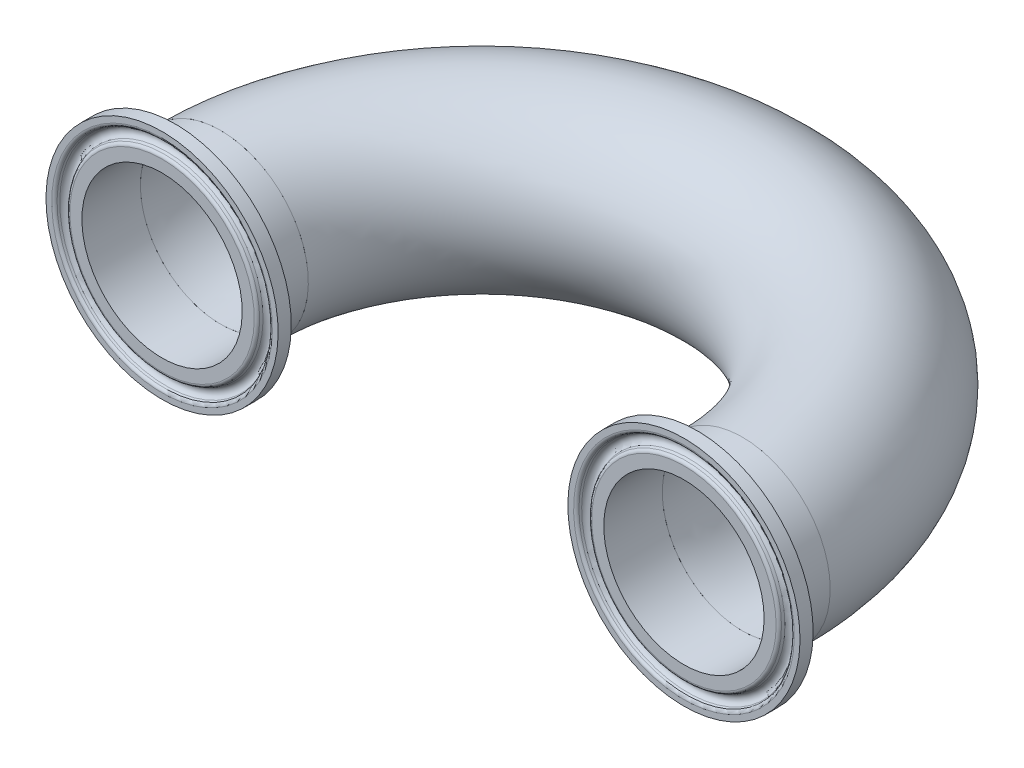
ISO-10303-21;
HEADER;
FILE_DESCRIPTION(('STEP AP214'),'2;1');
FILE_NAME('part.step','',(''),(''),'','','');
FILE_SCHEMA(('AUTOMOTIVE_DESIGN { 1 0 10303 214 1 1 1 1 }'));
ENDSEC;
DATA;
#1=APPLICATION_CONTEXT('core data for automotive mechanical design processes');
#2=APPLICATION_PROTOCOL_DEFINITION('international standard','automotive_design',2000,#1);
#3=PRODUCT_CONTEXT('',#1,'mechanical');
#4=PRODUCT('Part','Part','',(#3));
#5=PRODUCT_RELATED_PRODUCT_CATEGORY('part','',(#4));
#6=PRODUCT_DEFINITION_FORMATION('','',#4);
#7=PRODUCT_DEFINITION_CONTEXT('part definition',#1,'design');
#8=PRODUCT_DEFINITION('design','',#6,#7);
#9=PRODUCT_DEFINITION_SHAPE('','',#8);
#10=(LENGTH_UNIT() NAMED_UNIT(*) SI_UNIT(.MILLI.,.METRE.));
#11=(NAMED_UNIT(*) PLANE_ANGLE_UNIT() SI_UNIT($,.RADIAN.));
#12=(NAMED_UNIT(*) SI_UNIT($,.STERADIAN.) SOLID_ANGLE_UNIT());
#13=UNCERTAINTY_MEASURE_WITH_UNIT(LENGTH_MEASURE(1.E-05),#10,'distance_accuracy_value','');
#14=(GEOMETRIC_REPRESENTATION_CONTEXT(3) GLOBAL_UNCERTAINTY_ASSIGNED_CONTEXT((#13)) GLOBAL_UNIT_ASSIGNED_CONTEXT((#10,
#11,#12)) REPRESENTATION_CONTEXT('',''));
#15=CARTESIAN_POINT('',(0.,0.,0.));
#16=DIRECTION('',(0.,0.,1.));
#17=DIRECTION('',(1.,0.,0.));
#18=AXIS2_PLACEMENT_3D('',#15,#16,#17);
#19=CARTESIAN_POINT('',(-9.0308097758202,66.8355473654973,99.0497360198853));
#20=DIRECTION('',(0.,0.,-1.));
#21=DIRECTION('',(-1.,0.,0.));
#22=AXIS2_PLACEMENT_3D('',#19,#20,#21);
#23=CIRCLE('',#22,19.05);
#24=CARTESIAN_POINT('',(48.116900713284,66.8355473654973,99.5612884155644));
#25=DIRECTION('',(0.,-1.,0.));
#26=AXIS1_PLACEMENT('',#24,#25);
#27=SURFACE_OF_REVOLUTION('',#23,#26);
#28=CARTESIAN_POINT('',(-28.0808097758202,66.8355473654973,99.0497360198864));
#29=VERTEX_POINT('',#28);
#30=EDGE_CURVE('P0_E10',#29,#29,#23,.T.);
#31=ORIENTED_EDGE('',*,*,#30,.T.);
#32=EDGE_LOOP('',(#31));
#33=FACE_BOUND('',#32,.T.);
#34=CARTESIAN_POINT('',(105.264611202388,66.8355473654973,100.072840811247));
#35=DIRECTION('',(0.,0.,1.));
#36=DIRECTION('',(1.,0.,0.));
#37=AXIS2_PLACEMENT_3D('',#34,#35,#36);
#38=CIRCLE('',#37,19.05);
#39=CARTESIAN_POINT('',(124.314611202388,66.8355473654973,100.072840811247));
#40=VERTEX_POINT('',#39);
#41=EDGE_CURVE('P0_E22',#40,#40,#38,.T.);
#42=ORIENTED_EDGE('',*,*,#41,.F.);
#43=EDGE_LOOP('',(#42));
#44=FACE_BOUND('',#43,.T.);
#45=ADVANCED_FACE('P0_F15',(#33,#44),#27,.F.);
#46=CARTESIAN_POINT('',(-9.0308097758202,66.8355473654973,99.0497360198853));
#47=DIRECTION('',(0.,0.,-1.));
#48=DIRECTION('',(-1.,0.,0.));
#49=AXIS2_PLACEMENT_3D('',#46,#47,#48);
#50=PLANE('',#49);
#51=CARTESIAN_POINT('',(8.36804757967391,66.8355473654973,99.0497360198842));
#52=CARTESIAN_POINT('',(8.36804880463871,66.3466914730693,99.0497360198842));
#53=CARTESIAN_POINT('',(8.34742919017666,65.8578682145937,99.0497360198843));
#54=CARTESIAN_POINT('',(8.28571312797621,65.1272947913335,99.0497360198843));
#55=CARTESIAN_POINT('',(8.26000280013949,64.8841715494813,99.0497360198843));
#56=CARTESIAN_POINT('',(8.19835654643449,64.3991598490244,99.0497360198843));
#57=CARTESIAN_POINT('',(8.16241786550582,64.1572717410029,99.0497360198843));
#58=CARTESIAN_POINT('',(8.03927717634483,63.4337753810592,99.0497360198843));
#59=CARTESIAN_POINT('',(7.93678025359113,62.9546867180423,99.0497360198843));
#60=CARTESIAN_POINT('',(7.69175482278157,62.0068605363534,99.0497360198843));
#61=CARTESIAN_POINT('',(7.54922645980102,61.5381229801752,99.0497360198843));
#62=CARTESIAN_POINT('',(7.30625823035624,60.8454580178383,99.0497360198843));
#63=CARTESIAN_POINT('',(7.22041291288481,60.6163248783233,99.0497360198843));
#64=CARTESIAN_POINT('',(7.03916353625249,60.1619403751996,99.0497360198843));
#65=CARTESIAN_POINT('',(6.94376192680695,59.9366880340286,99.0497360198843));
#66=CARTESIAN_POINT('',(6.64340929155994,59.2672218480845,99.0497360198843));
#67=CARTESIAN_POINT('',(6.42429767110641,58.8292623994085,99.0497360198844));
#68=CARTESIAN_POINT('',(5.95004175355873,57.9735290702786,99.0497360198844));
#69=CARTESIAN_POINT('',(5.6949066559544,57.5557500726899,99.0497360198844));
#70=CARTESIAN_POINT('',(5.15034599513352,56.7431536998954,99.0497360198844));
#71=CARTESIAN_POINT('',(4.86092056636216,56.3483362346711,99.0497360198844));
#72=CARTESIAN_POINT('',(4.24981402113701,55.5844508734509,99.0497360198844));
#73=CARTESIAN_POINT('',(3.92812978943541,55.2153854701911,99.0497360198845));
#74=CARTESIAN_POINT('',(3.25481332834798,54.5056642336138,99.0497360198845));
#75=CARTESIAN_POINT('',(2.90318106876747,54.1650084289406,99.0497360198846));
#76=CARTESIAN_POINT('',(2.17245497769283,53.5145174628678,99.0497360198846));
#77=CARTESIAN_POINT('',(1.79336007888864,53.2046835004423,99.0497360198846));
#78=CARTESIAN_POINT('',(1.01041600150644,52.6180538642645,99.0497360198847));
#79=CARTESIAN_POINT('',(0.606566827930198,52.3412581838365,99.0497360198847));
#80=CARTESIAN_POINT('',(-0.223002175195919,51.8226808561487,99.0497360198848));
#81=CARTESIAN_POINT('',(-0.648721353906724,51.5808981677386,99.0497360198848));
#82=CARTESIAN_POINT('',(-1.51901480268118,51.1340559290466,99.0497360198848));
#83=CARTESIAN_POINT('',(-1.96358907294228,50.9289963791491,99.0497360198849));
#84=CARTESIAN_POINT('',(-2.86843108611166,50.5570586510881,99.0497360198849));
#85=CARTESIAN_POINT('',(-3.32869879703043,50.3901803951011,99.0497360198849));
#86=CARTESIAN_POINT('',(-4.26165631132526,50.0957910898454,99.049736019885));
#87=CARTESIAN_POINT('',(-4.73434611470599,49.9682800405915,99.049736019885));
#88=CARTESIAN_POINT('',(-5.68878741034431,49.7535316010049,99.0497360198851));
#89=CARTESIAN_POINT('',(-6.17053890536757,49.666294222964,99.0497360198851));
#90=CARTESIAN_POINT('',(-7.13967847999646,49.5327133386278,99.0497360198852));
#91=CARTESIAN_POINT('',(-7.6270665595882,49.4863698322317,99.0497360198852));
#92=CARTESIAN_POINT('',(-8.60401340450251,49.4349061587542,99.0497360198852));
#93=CARTESIAN_POINT('',(-9.0935721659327,49.4297859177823,99.0497360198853));
#94=CARTESIAN_POINT('',(-10.0713808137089,49.460804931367,99.0497360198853));
#95=CARTESIAN_POINT('',(-10.5596307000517,49.4969441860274,99.0497360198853));
#96=CARTESIAN_POINT('',(-11.531352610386,49.6102254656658,99.0497360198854));
#97=CARTESIAN_POINT('',(-12.0148246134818,49.6873676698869,99.0497360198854));
#98=CARTESIAN_POINT('',(-12.9735514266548,49.882106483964,99.0497360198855));
#99=CARTESIAN_POINT('',(-13.4488062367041,49.9997030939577,99.0497360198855));
#100=CARTESIAN_POINT('',(-14.3877204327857,50.2745147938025,99.0497360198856));
#101=CARTESIAN_POINT('',(-14.8513798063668,50.4317299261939,99.0497360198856));
#102=CARTESIAN_POINT('',(-15.7638063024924,50.7846608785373,99.0497360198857));
#103=CARTESIAN_POINT('',(-16.2125734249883,50.9803766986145,99.0497360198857));
#104=CARTESIAN_POINT('',(-17.0920268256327,51.4089184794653,99.0497360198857));
#105=CARTESIAN_POINT('',(-17.5227130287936,51.6417445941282,99.0497360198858));
#106=CARTESIAN_POINT('',(-18.3629407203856,52.1428511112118,99.0497360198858));
#107=CARTESIAN_POINT('',(-18.772482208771,52.4111315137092,99.0497360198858));
#108=CARTESIAN_POINT('',(-19.5675087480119,52.9812391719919,99.0497360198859));
#109=CARTESIAN_POINT('',(-19.952993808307,53.2830664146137,99.0497360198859));
#110=CARTESIAN_POINT('',(-20.6971671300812,53.9181220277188,99.049736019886));
#111=CARTESIAN_POINT('',(-21.0558553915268,54.2513503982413,99.049736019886));
#112=CARTESIAN_POINT('',(-21.7438861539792,54.9468402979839,99.049736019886));
#113=CARTESIAN_POINT('',(-22.0732285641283,55.3091019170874,99.0497360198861));
#114=CARTESIAN_POINT('',(-22.7002249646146,56.0600819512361,99.0497360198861));
#115=CARTESIAN_POINT('',(-22.9978789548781,56.4488003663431,99.0497360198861));
#116=CARTESIAN_POINT('',(-23.5593824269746,57.2499304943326,99.0497360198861));
#117=CARTESIAN_POINT('',(-23.8232319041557,57.6623422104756,99.0497360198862));
#118=CARTESIAN_POINT('',(-24.3152505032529,58.507926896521,99.0497360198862));
#119=CARTESIAN_POINT('',(-24.5434196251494,58.9410998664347,99.0497360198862));
#120=CARTESIAN_POINT('',(-24.962455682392,59.8251281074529,99.0497360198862));
#121=CARTESIAN_POINT('',(-25.1533225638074,60.2759834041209,99.0497360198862));
#122=CARTESIAN_POINT('',(-25.4963967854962,61.1921704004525,99.0497360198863));
#123=CARTESIAN_POINT('',(-25.6486041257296,61.6575021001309,99.0497360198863));
#124=CARTESIAN_POINT('',(-25.9132771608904,62.599333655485,99.0497360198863));
#125=CARTESIAN_POINT('',(-26.0257428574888,63.075833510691,99.0497360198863));
#126=CARTESIAN_POINT('',(-26.2101330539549,64.0366137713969,99.0497360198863));
#127=CARTESIAN_POINT('',(-26.2820575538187,64.5208941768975,99.0497360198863));
#128=CARTESIAN_POINT('',(-26.3848540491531,65.4937928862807,99.0497360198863));
#129=CARTESIAN_POINT('',(-26.4157260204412,65.9824111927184,99.0497360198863));
#130=CARTESIAN_POINT('',(-26.4361978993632,66.9605116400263,99.0497360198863));
#131=CARTESIAN_POINT('',(-26.4257978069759,67.4499937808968,99.0497360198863));
#132=CARTESIAN_POINT('',(-26.3637994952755,68.426341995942,99.0497360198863));
#133=CARTESIAN_POINT('',(-26.3122012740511,68.9132080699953,99.0497360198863));
#134=CARTESIAN_POINT('',(-26.1681735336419,69.8808628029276,99.0497360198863));
#135=CARTESIAN_POINT('',(-26.0757440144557,70.3616514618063,99.0497360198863));
#136=CARTESIAN_POINT('',(-25.8507107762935,71.3137333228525,99.0497360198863));
#137=CARTESIAN_POINT('',(-25.718107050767,71.7850265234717,99.0497360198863));
#138=CARTESIAN_POINT('',(-25.4136681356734,72.7147667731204,99.0497360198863));
#139=CARTESIAN_POINT('',(-25.2418329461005,73.173213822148,99.0497360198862));
#140=CARTESIAN_POINT('',(-24.8601527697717,74.0740024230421,99.0497360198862));
#141=CARTESIAN_POINT('',(-24.650307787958,74.5163439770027,99.0497360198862));
#142=CARTESIAN_POINT('',(-24.1940998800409,75.3817768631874,99.0497360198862));
#143=CARTESIAN_POINT('',(-23.9477369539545,75.8048681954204,99.0497360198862));
#144=CARTESIAN_POINT('',(-23.4202447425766,76.6287925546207,99.0497360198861));
#145=CARTESIAN_POINT('',(-23.1391154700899,77.0296255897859,99.0497360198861));
#146=CARTESIAN_POINT('',(-22.5440891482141,77.8061838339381,99.0497360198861));
#147=CARTESIAN_POINT('',(-22.2301920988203,78.1819090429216,99.0497360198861));
#148=CARTESIAN_POINT('',(-21.5718617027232,78.9055805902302,99.049736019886));
#149=CARTESIAN_POINT('',(-21.2274283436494,79.2535269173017,99.049736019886));
#150=CARTESIAN_POINT('',(-20.5104741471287,79.9191668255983,99.049736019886));
#151=CARTESIAN_POINT('',(-20.1379533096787,80.23686040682,99.0497360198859));
#152=CARTESIAN_POINT('',(-19.3674727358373,80.8397360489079,99.0497360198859));
#153=CARTESIAN_POINT('',(-18.969513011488,81.124918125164,99.0497360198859));
#154=CARTESIAN_POINT('',(-18.1509837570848,81.6607434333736,99.0497360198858));
#155=CARTESIAN_POINT('',(-17.7304142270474,81.9113866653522,99.0497360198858));
#156=CARTESIAN_POINT('',(-16.869655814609,82.3763520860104,99.0497360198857));
#157=CARTESIAN_POINT('',(-16.4294669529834,82.5906743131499,99.0497360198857));
#158=CARTESIAN_POINT('',(-15.5325989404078,82.9814743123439,99.0497360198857));
#159=CARTESIAN_POINT('',(-15.075919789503,83.157952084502,99.0497360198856));
#160=CARTESIAN_POINT('',(-14.1493189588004,83.4718081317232,99.0497360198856));
#161=CARTESIAN_POINT('',(-13.6793973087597,83.6091864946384,99.0497360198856));
#162=CARTESIAN_POINT('',(-12.7296513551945,83.843867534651,99.0497360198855));
#163=CARTESIAN_POINT('',(-12.249827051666,83.9411702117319,99.0497360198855));
#164=CARTESIAN_POINT('',(-11.2836861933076,84.0950082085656,99.0497360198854));
#165=CARTESIAN_POINT('',(-10.7973696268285,84.1515434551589,99.0497360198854));
#166=CARTESIAN_POINT('',(-9.82170253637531,84.2234443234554,99.0497360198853));
#167=CARTESIAN_POINT('',(-9.33235201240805,84.2388099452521,99.0497360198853));
#168=CARTESIAN_POINT('',(-8.35409867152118,84.2282623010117,99.0497360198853));
#169=CARTESIAN_POINT('',(-7.8651958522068,84.2023492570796,99.0497360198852));
#170=CARTESIAN_POINT('',(-6.89131110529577,84.1094288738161,99.0497360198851));
#171=CARTESIAN_POINT('',(-6.40632917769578,84.0424215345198,99.0497360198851));
#172=CARTESIAN_POINT('',(-5.44373320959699,83.8677887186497,99.0497360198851));
#173=CARTESIAN_POINT('',(-4.9661191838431,83.7601631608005,99.049736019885));
#174=CARTESIAN_POINT('',(-4.02165563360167,83.5050590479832,99.049736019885));
#175=CARTESIAN_POINT('',(-3.55480610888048,83.3575804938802,99.049736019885));
#176=CARTESIAN_POINT('',(-2.63518423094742,83.0238165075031,99.0497360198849));
#177=CARTESIAN_POINT('',(-2.18241207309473,82.8375305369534,99.0497360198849));
#178=CARTESIAN_POINT('',(-1.2941707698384,82.4274774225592,99.0497360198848));
#179=CARTESIAN_POINT('',(-0.858701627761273,82.203710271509,99.0497360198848));
#180=CARTESIAN_POINT('',(-0.00817887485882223,81.7202948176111,99.0497360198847));
#181=CARTESIAN_POINT('',(0.406875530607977,81.4606479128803,99.0497360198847));
#182=CARTESIAN_POINT('',(1.2136350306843,80.907313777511,99.0497360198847));
#183=CARTESIAN_POINT('',(1.60534014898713,80.6136265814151,99.0497360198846));
#184=CARTESIAN_POINT('',(2.36257869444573,79.9943285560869,99.0497360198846));
#185=CARTESIAN_POINT('',(2.72811497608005,79.6687212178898,99.0497360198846));
#186=CARTESIAN_POINT('',(3.43045417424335,78.9878871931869,99.0497360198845));
#187=CARTESIAN_POINT('',(3.76725697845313,78.6326603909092,99.0497360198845));
#188=CARTESIAN_POINT('',(4.40986102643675,77.8949515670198,99.0497360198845));
#189=CARTESIAN_POINT('',(4.7156543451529,77.5124626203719,99.0497360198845));
#190=CARTESIAN_POINT('',(5.14927364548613,76.9205620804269,99.0497360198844));
#191=CARTESIAN_POINT('',(5.28963999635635,76.7202258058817,99.0497360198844));
#192=CARTESIAN_POINT('',(5.56184095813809,76.313762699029,99.0497360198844));
#193=CARTESIAN_POINT('',(5.69367337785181,76.1076343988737,99.0497360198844));
#194=CARTESIAN_POINT('',(6.07602675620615,75.4810540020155,99.0497360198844));
#195=CARTESIAN_POINT('',(6.31336367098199,75.0524612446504,99.0497360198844));
#196=CARTESIAN_POINT('',(6.7510543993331,74.1767876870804,99.0497360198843));
#197=CARTESIAN_POINT('',(6.95140807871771,73.7297068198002,99.0497360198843));
#198=CARTESIAN_POINT('',(7.22302691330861,73.0479338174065,99.0497360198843));
#199=CARTESIAN_POINT('',(7.30872227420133,72.8189019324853,99.0497360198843));
#200=CARTESIAN_POINT('',(7.47036629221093,72.3574918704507,99.0497360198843));
#201=CARTESIAN_POINT('',(7.54631757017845,72.1251146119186,99.0497360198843));
#202=CARTESIAN_POINT('',(7.75934887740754,71.4235842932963,99.0497360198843));
#203=CARTESIAN_POINT('',(7.88166993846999,70.9498730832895,99.0497360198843));
#204=CARTESIAN_POINT('',(8.11142250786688,69.8747896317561,99.0497360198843));
#205=CARTESIAN_POINT('',(8.20757148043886,69.2709875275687,99.0497360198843));
#206=CARTESIAN_POINT('',(8.33588325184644,68.0566224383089,99.0497360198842));
#207=CARTESIAN_POINT('',(8.36804604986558,67.4460594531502,99.0497360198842));
#208=CARTESIAN_POINT('',(8.36804757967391,66.8355473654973,99.0497360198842));
#209=B_SPLINE_CURVE_WITH_KNOTS('',3,(#51,#52,#53,#54,#55,#56,#57,#58,#59,#60,#61,#62,#63,#64,
#65,#66,#67,#68,#69,#70,#71,#72,#73,#74,#75,#76,#77,#78,#79,#80,#81,#82,#83,#84,#85,#86,#87,#88,
#89,#90,#91,#92,#93,#94,#95,#96,#97,#98,#99,#100,#101,#102,#103,#104,#105,#106,#107,#108,#109,
#110,#111,#112,#113,#114,#115,#116,#117,#118,#119,#120,#121,#122,#123,#124,#125,#126,#127,#128,
#129,#130,#131,#132,#133,#134,#135,#136,#137,#138,#139,#140,#141,#142,#143,#144,#145,#146,#147,
#148,#149,#150,#151,#152,#153,#154,#155,#156,#157,#158,#159,#160,#161,#162,#163,#164,#165,#166,
#167,#168,#169,#170,#171,#172,#173,#174,#175,#176,#177,#178,#179,#180,#181,#182,#183,#184,#185,
#186,#187,#188,#189,#190,#191,#192,#193,#194,#195,#196,#197,#198,#199,#200,#201,#202,#203,#204,
#205,#206,#207,#208),.UNSPECIFIED.,.T.,.F.,(4,2,2,2,2,2,2,2,2,2,2,2,2,2,2,2,2,2,2,2,2,2,2,2,2,2,
2,2,2,2,2,2,2,2,2,2,2,2,2,2,2,2,2,2,2,2,2,2,2,2,2,2,2,2,2,2,2,2,2,2,2,2,2,2,2,2,2,2,2,2,2,2,2,2,
2,2,2,2,4),(0.,1.46597263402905,2.19921582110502,2.93265669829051,4.40059365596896,
5.86852529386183,6.60239310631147,7.33607327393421,8.80331812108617,10.2701889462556,
11.7370540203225,13.2040608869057,14.6710692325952,16.1381346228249,17.6051997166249,
19.0722211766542,20.5392426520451,22.0062611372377,23.473279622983,24.9402985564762,
26.4073174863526,27.8743337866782,29.3413500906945,30.80837280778,32.2753955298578,
33.7424198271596,35.2094441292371,36.6764745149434,38.1435049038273,39.6105347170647,
41.0775645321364,42.5445988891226,44.0116332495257,45.4786678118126,46.9457023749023,
48.4127390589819,49.8797757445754,51.3468123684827,52.8138489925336,54.2808864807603,
55.7479239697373,57.2149615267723,58.6819990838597,60.1490368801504,61.616074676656,
63.0831122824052,64.5501498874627,66.0171869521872,67.4842240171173,68.9512616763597,
70.4182993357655,71.8853363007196,73.3523732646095,74.8194086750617,76.2864440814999,
77.7534761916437,79.2205083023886,80.6875430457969,82.1545777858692,83.6216046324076,
85.0886314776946,86.5556612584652,88.0226910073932,89.4897411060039,90.9567914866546,
92.4237847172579,93.8907764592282,95.3576079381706,96.8244451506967,98.2916563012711,
99.0253196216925,99.759170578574,101.227075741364,102.694986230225,103.42841394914,
104.161643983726,105.627590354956,107.458383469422,109.289176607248),.UNSPECIFIED.);
#210=CARTESIAN_POINT('',(8.36804757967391,66.8355473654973,99.0497360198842));
#211=VERTEX_POINT('',#210);
#212=EDGE_CURVE('P0_E26',#211,#211,#209,.T.);
#213=ORIENTED_EDGE('',*,*,#212,.T.);
#214=EDGE_LOOP('',(#213));
#215=FACE_BOUND('',#214,.T.);
#216=ORIENTED_EDGE('',*,*,#30,.F.);
#217=EDGE_LOOP('',(#216));
#218=FACE_BOUND('',#217,.T.);
#219=ADVANCED_FACE('P0_F53',(#215,#218),#50,.F.);
#220=CARTESIAN_POINT('',(105.264611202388,66.8355473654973,100.072840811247));
#221=DIRECTION('',(0.,0.,1.));
#222=DIRECTION('',(1.,0.,0.));
#223=AXIS2_PLACEMENT_3D('',#220,#221,#222);
#224=PLANE('',#223);
#225=CARTESIAN_POINT('',(87.8657538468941,66.8355473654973,100.072840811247));
#226=CARTESIAN_POINT('',(87.8657526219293,66.3466914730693,100.072840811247));
#227=CARTESIAN_POINT('',(87.8863722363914,65.8578682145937,100.072840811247));
#228=CARTESIAN_POINT('',(87.9480882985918,65.1272947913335,100.072840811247));
#229=CARTESIAN_POINT('',(87.9737986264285,64.8841715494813,100.072840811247));
#230=CARTESIAN_POINT('',(88.0354448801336,64.3991598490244,100.072840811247));
#231=CARTESIAN_POINT('',(88.0713835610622,64.157271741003,100.072840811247));
#232=CARTESIAN_POINT('',(88.1945242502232,63.4337753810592,100.072840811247));
#233=CARTESIAN_POINT('',(88.2970211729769,62.9546867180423,100.072840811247));
#234=CARTESIAN_POINT('',(88.5420466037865,62.0068605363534,100.072840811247));
#235=CARTESIAN_POINT('',(88.684574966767,61.5381229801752,100.072840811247));
#236=CARTESIAN_POINT('',(88.9275431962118,60.8454580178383,100.072840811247));
#237=CARTESIAN_POINT('',(89.0133885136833,60.6163248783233,100.072840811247));
#238=CARTESIAN_POINT('',(89.1946378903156,60.1619403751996,100.072840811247));
#239=CARTESIAN_POINT('',(89.2900394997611,59.9366880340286,100.072840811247));
#240=CARTESIAN_POINT('',(89.5903921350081,59.2672218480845,100.072840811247));
#241=CARTESIAN_POINT('',(89.8095037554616,58.8292623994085,100.072840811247));
#242=CARTESIAN_POINT('',(90.2837596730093,57.9735290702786,100.072840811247));
#243=CARTESIAN_POINT('',(90.5388947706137,57.5557500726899,100.072840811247));
#244=CARTESIAN_POINT('',(91.0834554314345,56.7431536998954,100.072840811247));
#245=CARTESIAN_POINT('',(91.3728808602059,56.3483362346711,100.072840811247));
#246=CARTESIAN_POINT('',(91.983987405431,55.5844508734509,100.072840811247));
#247=CARTESIAN_POINT('',(92.3056716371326,55.2153854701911,100.072840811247));
#248=CARTESIAN_POINT('',(92.9789880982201,54.5056642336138,100.072840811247));
#249=CARTESIAN_POINT('',(93.3306203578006,54.1650084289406,100.072840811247));
#250=CARTESIAN_POINT('',(94.0613464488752,53.5145174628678,100.072840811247));
#251=CARTESIAN_POINT('',(94.4404413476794,53.2046835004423,100.072840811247));
#252=CARTESIAN_POINT('',(95.2233854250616,52.6180538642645,100.072840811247));
#253=CARTESIAN_POINT('',(95.6272345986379,52.3412581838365,100.072840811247));
#254=CARTESIAN_POINT('',(96.456803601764,51.8226808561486,100.072840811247));
#255=CARTESIAN_POINT('',(96.8825227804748,51.5808981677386,100.072840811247));
#256=CARTESIAN_POINT('',(97.7528162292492,51.1340559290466,100.072840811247));
#257=CARTESIAN_POINT('',(98.1973904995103,50.9289963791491,100.072840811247));
#258=CARTESIAN_POINT('',(99.1022325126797,50.5570586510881,100.072840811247));
#259=CARTESIAN_POINT('',(99.5625002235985,50.3901803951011,100.072840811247));
#260=CARTESIAN_POINT('',(100.495457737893,50.0957910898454,100.072840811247));
#261=CARTESIAN_POINT('',(100.968147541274,49.9682800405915,100.072840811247));
#262=CARTESIAN_POINT('',(101.922588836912,49.7535316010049,100.072840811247));
#263=CARTESIAN_POINT('',(102.404340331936,49.666294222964,100.072840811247));
#264=CARTESIAN_POINT('',(103.373479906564,49.5327133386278,100.072840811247));
#265=CARTESIAN_POINT('',(103.860867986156,49.4863698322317,100.072840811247));
#266=CARTESIAN_POINT('',(104.837814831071,49.4349061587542,100.072840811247));
#267=CARTESIAN_POINT('',(105.327373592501,49.4297859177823,100.072840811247));
#268=CARTESIAN_POINT('',(106.305182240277,49.460804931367,100.072840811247));
#269=CARTESIAN_POINT('',(106.79343212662,49.4969441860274,100.072840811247));
#270=CARTESIAN_POINT('',(107.765154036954,49.6102254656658,100.072840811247));
#271=CARTESIAN_POINT('',(108.24862604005,49.6873676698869,100.072840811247));
#272=CARTESIAN_POINT('',(109.207352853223,49.882106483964,100.072840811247));
#273=CARTESIAN_POINT('',(109.682607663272,49.9997030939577,100.072840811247));
#274=CARTESIAN_POINT('',(110.621521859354,50.2745147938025,100.072840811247));
#275=CARTESIAN_POINT('',(111.085181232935,50.4317299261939,100.072840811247));
#276=CARTESIAN_POINT('',(111.99760772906,50.7846608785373,100.072840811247));
#277=CARTESIAN_POINT('',(112.446374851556,50.9803766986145,100.072840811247));
#278=CARTESIAN_POINT('',(113.325828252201,51.4089184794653,100.072840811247));
#279=CARTESIAN_POINT('',(113.756514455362,51.6417445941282,100.072840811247));
#280=CARTESIAN_POINT('',(114.596742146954,52.1428511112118,100.072840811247));
#281=CARTESIAN_POINT('',(115.006283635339,52.4111315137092,100.072840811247));
#282=CARTESIAN_POINT('',(115.80131017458,52.9812391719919,100.072840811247));
#283=CARTESIAN_POINT('',(116.186795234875,53.2830664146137,100.072840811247));
#284=CARTESIAN_POINT('',(116.930968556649,53.9181220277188,100.072840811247));
#285=CARTESIAN_POINT('',(117.289656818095,54.2513503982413,100.072840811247));
#286=CARTESIAN_POINT('',(117.977687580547,54.9468402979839,100.072840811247));
#287=CARTESIAN_POINT('',(118.307029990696,55.3091019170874,100.072840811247));
#288=CARTESIAN_POINT('',(118.934026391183,56.0600819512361,100.072840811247));
#289=CARTESIAN_POINT('',(119.231680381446,56.4488003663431,100.072840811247));
#290=CARTESIAN_POINT('',(119.793183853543,57.2499304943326,100.072840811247));
#291=CARTESIAN_POINT('',(120.057033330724,57.6623422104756,100.072840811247));
#292=CARTESIAN_POINT('',(120.549051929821,58.507926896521,100.072840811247));
#293=CARTESIAN_POINT('',(120.777221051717,58.9410998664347,100.072840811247));
#294=CARTESIAN_POINT('',(121.19625710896,59.8251281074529,100.072840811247));
#295=CARTESIAN_POINT('',(121.387123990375,60.2759834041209,100.072840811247));
#296=CARTESIAN_POINT('',(121.730198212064,61.1921704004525,100.072840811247));
#297=CARTESIAN_POINT('',(121.882405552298,61.6575021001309,100.072840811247));
#298=CARTESIAN_POINT('',(122.147078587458,62.599333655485,100.072840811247));
#299=CARTESIAN_POINT('',(122.259544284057,63.075833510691,100.072840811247));
#300=CARTESIAN_POINT('',(122.443934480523,64.0366137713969,100.072840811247));
#301=CARTESIAN_POINT('',(122.515858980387,64.5208941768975,100.072840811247));
#302=CARTESIAN_POINT('',(122.618655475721,65.4937928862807,100.072840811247));
#303=CARTESIAN_POINT('',(122.649527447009,65.9824111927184,100.072840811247));
#304=CARTESIAN_POINT('',(122.669999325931,66.9605116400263,100.072840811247));
#305=CARTESIAN_POINT('',(122.659599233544,67.4499937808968,100.072840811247));
#306=CARTESIAN_POINT('',(122.597600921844,68.426341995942,100.072840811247));
#307=CARTESIAN_POINT('',(122.546002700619,68.9132080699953,100.072840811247));
#308=CARTESIAN_POINT('',(122.40197496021,69.8808628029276,100.072840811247));
#309=CARTESIAN_POINT('',(122.309545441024,70.3616514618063,100.072840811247));
#310=CARTESIAN_POINT('',(122.084512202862,71.3137333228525,100.072840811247));
#311=CARTESIAN_POINT('',(121.951908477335,71.7850265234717,100.072840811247));
#312=CARTESIAN_POINT('',(121.647469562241,72.7147667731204,100.072840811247));
#313=CARTESIAN_POINT('',(121.475634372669,73.173213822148,100.072840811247));
#314=CARTESIAN_POINT('',(121.09395419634,74.0740024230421,100.072840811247));
#315=CARTESIAN_POINT('',(120.884109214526,74.5163439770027,100.072840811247));
#316=CARTESIAN_POINT('',(120.427901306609,75.3817768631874,100.072840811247));
#317=CARTESIAN_POINT('',(120.181538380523,75.8048681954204,100.072840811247));
#318=CARTESIAN_POINT('',(119.654046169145,76.6287925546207,100.072840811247));
#319=CARTESIAN_POINT('',(119.372916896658,77.0296255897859,100.072840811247));
#320=CARTESIAN_POINT('',(118.777890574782,77.8061838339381,100.072840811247));
#321=CARTESIAN_POINT('',(118.463993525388,78.1819090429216,100.072840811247));
#322=CARTESIAN_POINT('',(117.805663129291,78.9055805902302,100.072840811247));
#323=CARTESIAN_POINT('',(117.461229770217,79.2535269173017,100.072840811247));
#324=CARTESIAN_POINT('',(116.744275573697,79.9191668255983,100.072840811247));
#325=CARTESIAN_POINT('',(116.371754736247,80.23686040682,100.072840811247));
#326=CARTESIAN_POINT('',(115.601274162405,80.8397360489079,100.072840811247));
#327=CARTESIAN_POINT('',(115.203314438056,81.124918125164,100.072840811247));
#328=CARTESIAN_POINT('',(114.384785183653,81.6607434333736,100.072840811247));
#329=CARTESIAN_POINT('',(113.964215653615,81.9113866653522,100.072840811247));
#330=CARTESIAN_POINT('',(113.103457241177,82.3763520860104,100.072840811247));
#331=CARTESIAN_POINT('',(112.663268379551,82.5906743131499,100.072840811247));
#332=CARTESIAN_POINT('',(111.766400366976,82.9814743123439,100.072840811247));
#333=CARTESIAN_POINT('',(111.309721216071,83.157952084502,100.072840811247));
#334=CARTESIAN_POINT('',(110.383120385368,83.4718081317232,100.072840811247));
#335=CARTESIAN_POINT('',(109.913198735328,83.6091864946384,100.072840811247));
#336=CARTESIAN_POINT('',(108.963452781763,83.8438675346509,100.072840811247));
#337=CARTESIAN_POINT('',(108.483628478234,83.9411702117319,100.072840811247));
#338=CARTESIAN_POINT('',(107.517487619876,84.0950082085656,100.072840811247));
#339=CARTESIAN_POINT('',(107.031171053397,84.1515434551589,100.072840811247));
#340=CARTESIAN_POINT('',(106.055503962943,84.2234443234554,100.072840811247));
#341=CARTESIAN_POINT('',(105.566153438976,84.2388099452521,100.072840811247));
#342=CARTESIAN_POINT('',(104.587900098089,84.2282623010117,100.072840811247));
#343=CARTESIAN_POINT('',(104.098997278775,84.2023492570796,100.072840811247));
#344=CARTESIAN_POINT('',(103.125112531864,84.1094288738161,100.072840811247));
#345=CARTESIAN_POINT('',(102.640130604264,84.0424215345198,100.072840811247));
#346=CARTESIAN_POINT('',(101.677534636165,83.8677887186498,100.072840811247));
#347=CARTESIAN_POINT('',(101.199920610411,83.7601631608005,100.072840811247));
#348=CARTESIAN_POINT('',(100.25545706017,83.5050590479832,100.072840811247));
#349=CARTESIAN_POINT('',(99.7886075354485,83.3575804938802,100.072840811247));
#350=CARTESIAN_POINT('',(98.8689856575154,83.0238165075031,100.072840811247));
#351=CARTESIAN_POINT('',(98.4162134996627,82.8375305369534,100.072840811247));
#352=CARTESIAN_POINT('',(97.5279721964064,82.4274774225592,100.072840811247));
#353=CARTESIAN_POINT('',(97.0925030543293,82.2037102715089,100.072840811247));
#354=CARTESIAN_POINT('',(96.2419803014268,81.7202948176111,100.072840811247));
#355=CARTESIAN_POINT('',(95.82692589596,81.4606479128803,100.072840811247));
#356=CARTESIAN_POINT('',(95.0201663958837,80.907313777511,100.072840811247));
#357=CARTESIAN_POINT('',(94.6284612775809,80.6136265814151,100.072840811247));
#358=CARTESIAN_POINT('',(93.8712227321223,79.9943285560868,100.072840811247));
#359=CARTESIAN_POINT('',(93.505686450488,79.6687212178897,100.072840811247));
#360=CARTESIAN_POINT('',(92.8033472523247,78.9878871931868,100.072840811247));
#361=CARTESIAN_POINT('',(92.4665444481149,78.6326603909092,100.072840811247));
#362=CARTESIAN_POINT('',(91.8239404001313,77.8949515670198,100.072840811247));
#363=CARTESIAN_POINT('',(91.5181470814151,77.5124626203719,100.072840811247));
#364=CARTESIAN_POINT('',(91.0845277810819,76.9205620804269,100.072840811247));
#365=CARTESIAN_POINT('',(90.9441614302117,76.7202258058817,100.072840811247));
#366=CARTESIAN_POINT('',(90.67196046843,76.3137626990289,100.072840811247));
#367=CARTESIAN_POINT('',(90.5401280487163,76.1076343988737,100.072840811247));
#368=CARTESIAN_POINT('',(90.1577746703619,75.4810540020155,100.072840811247));
#369=CARTESIAN_POINT('',(89.920437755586,75.0524612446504,100.072840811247));
#370=CARTESIAN_POINT('',(89.4827470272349,74.1767876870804,100.072840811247));
#371=CARTESIAN_POINT('',(89.2823933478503,73.7297068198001,100.072840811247));
#372=CARTESIAN_POINT('',(89.0107745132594,73.0479338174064,100.072840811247));
#373=CARTESIAN_POINT('',(88.9250791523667,72.8189019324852,100.072840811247));
#374=CARTESIAN_POINT('',(88.7634351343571,72.3574918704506,100.072840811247));
#375=CARTESIAN_POINT('',(88.6874838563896,72.1251146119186,100.072840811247));
#376=CARTESIAN_POINT('',(88.4744525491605,71.4235842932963,100.072840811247));
#377=CARTESIAN_POINT('',(88.3521314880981,70.9498730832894,100.072840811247));
#378=CARTESIAN_POINT('',(88.1223789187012,69.8747896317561,100.072840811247));
#379=CARTESIAN_POINT('',(88.0262299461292,69.2709875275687,100.072840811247));
#380=CARTESIAN_POINT('',(87.8979181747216,68.0566224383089,100.072840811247));
#381=CARTESIAN_POINT('',(87.8657553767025,67.4460594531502,100.072840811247));
#382=CARTESIAN_POINT('',(87.8657538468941,66.8355473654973,100.072840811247));
#383=B_SPLINE_CURVE_WITH_KNOTS('',3,(#225,#226,#227,#228,#229,#230,#231,#232,#233,#234,#235,
#236,#237,#238,#239,#240,#241,#242,#243,#244,#245,#246,#247,#248,#249,#250,#251,#252,#253,#254,
#255,#256,#257,#258,#259,#260,#261,#262,#263,#264,#265,#266,#267,#268,#269,#270,#271,#272,#273,
#274,#275,#276,#277,#278,#279,#280,#281,#282,#283,#284,#285,#286,#287,#288,#289,#290,#291,#292,
#293,#294,#295,#296,#297,#298,#299,#300,#301,#302,#303,#304,#305,#306,#307,#308,#309,#310,#311,
#312,#313,#314,#315,#316,#317,#318,#319,#320,#321,#322,#323,#324,#325,#326,#327,#328,#329,#330,
#331,#332,#333,#334,#335,#336,#337,#338,#339,#340,#341,#342,#343,#344,#345,#346,#347,#348,#349,
#350,#351,#352,#353,#354,#355,#356,#357,#358,#359,#360,#361,#362,#363,#364,#365,#366,#367,#368,
#369,#370,#371,#372,#373,#374,#375,#376,#377,#378,#379,#380,#381,#382),.UNSPECIFIED.,.T.,.F.,(4,
2,2,2,2,2,2,2,2,2,2,2,2,2,2,2,2,2,2,2,2,2,2,2,2,2,2,2,2,2,2,2,2,2,2,2,2,2,2,2,2,2,2,2,2,2,2,2,2,
2,2,2,2,2,2,2,2,2,2,2,2,2,2,2,2,2,2,2,2,2,2,2,2,2,2,2,2,2,4),(0.,1.46597263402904,
2.199215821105,2.9326566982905,4.40059365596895,5.86852529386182,6.60239310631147,
7.3360732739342,8.80331812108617,10.2701889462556,11.7370540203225,13.2040608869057,
14.6710692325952,16.1381346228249,17.6051997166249,19.0722211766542,20.5392426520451,
22.0062611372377,23.4732796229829,24.9402985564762,26.4073174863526,27.8743337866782,
29.3413500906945,30.80837280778,32.2753955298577,33.7424198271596,35.2094441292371,
36.6764745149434,38.1435049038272,39.6105347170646,41.0775645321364,42.5445988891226,
44.0116332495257,45.4786678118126,46.9457023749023,48.4127390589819,49.8797757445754,
51.3468123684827,52.8138489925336,54.2808864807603,55.7479239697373,57.2149615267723,
58.6819990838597,60.1490368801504,61.6160746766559,63.0831122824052,64.5501498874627,
66.0171869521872,67.4842240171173,68.9512616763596,70.4182993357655,71.8853363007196,
73.3523732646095,74.8194086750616,76.2864440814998,77.7534761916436,79.2205083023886,
80.6875430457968,82.1545777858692,83.6216046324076,85.0886314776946,86.5556612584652,
88.0226910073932,89.4897411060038,90.9567914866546,92.4237847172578,93.8907764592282,
95.3576079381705,96.8244451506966,98.291656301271,99.0253196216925,99.7591705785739,
101.227075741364,102.694986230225,103.42841394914,104.161643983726,105.627590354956,
107.458383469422,109.289176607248),.UNSPECIFIED.);
#384=CARTESIAN_POINT('',(87.8657538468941,66.8355473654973,100.072840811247));
#385=VERTEX_POINT('',#384);
#386=EDGE_CURVE('P0_E30',#385,#385,#383,.T.);
#387=ORIENTED_EDGE('',*,*,#386,.F.);
#388=EDGE_LOOP('',(#387));
#389=FACE_BOUND('',#388,.T.);
#390=ORIENTED_EDGE('',*,*,#41,.T.);
#391=EDGE_LOOP('',(#390));
#392=FACE_BOUND('',#391,.T.);
#393=ADVANCED_FACE('P0_F48',(#389,#392),#224,.T.);
#394=CARTESIAN_POINT('',(-9.0308097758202,66.8355473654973,99.0497360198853));
#395=DIRECTION('',(0.,0.,-1.));
#396=DIRECTION('',(-1.,0.,0.));
#397=AXIS2_PLACEMENT_3D('',#394,#395,#396);
#398=CIRCLE('',#397,19.05);
#399=CARTESIAN_POINT('',(48.116900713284,66.8355473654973,99.5612884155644));
#400=DIRECTION('',(0.,-1.,0.));
#401=AXIS1_PLACEMENT('',#399,#400);
#402=SURFACE_OF_REVOLUTION('',#398,#401);
#403=OFFSET_SURFACE('',#402,1.651,.F.);
#404=ORIENTED_EDGE('',*,*,#212,.F.);
#405=EDGE_LOOP('',(#404));
#406=FACE_BOUND('',#405,.T.);
#407=ORIENTED_EDGE('',*,*,#386,.T.);
#408=EDGE_LOOP('',(#407));
#409=FACE_BOUND('',#408,.T.);
#410=ADVANCED_FACE('P0_F43',(#406,#409),#403,.T.);
#411=CLOSED_SHELL('',(#45,#219,#393,#410));
#412=MANIFOLD_SOLID_BREP('P0_B1',#411);
#413=CARTESIAN_POINT('',(105.26461120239,66.835547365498,111.78884185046));
#414=DIRECTION('',(0.,0.,-1.00000000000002));
#415=DIRECTION('',(-0.97001953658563,0.243026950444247,0.));
#416=AXIS2_PLACEMENT_3D('',#413,#414,#415);
#417=CONICAL_SURFACE('',#416,20.9336326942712,0.401425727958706);
#418=CARTESIAN_POINT('',(105.264611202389,66.8355473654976,112.308577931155));
#419=DIRECTION('',(0.,0.,1.00000000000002));
#420=DIRECTION('',(0.97001953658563,-0.243026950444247,0.));
#421=AXIS2_PLACEMENT_3D('',#418,#419,#420);
#422=CIRCLE('',#421,20.7130178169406);
#423=CARTESIAN_POINT('',(125.356643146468,61.8017258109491,112.308577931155));
#424=VERTEX_POINT('',#423);
#425=EDGE_CURVE('P1_E9',#424,#424,#422,.T.);
#426=ORIENTED_EDGE('',*,*,#425,.F.);
#427=EDGE_LOOP('',(#426));
#428=FACE_BOUND('',#427,.T.);
#429=CARTESIAN_POINT('',(105.26461120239,66.835547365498,111.78884185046));
#430=DIRECTION('',(0.,0.,1.00000000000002));
#431=DIRECTION('',(0.97001953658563,-0.243026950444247,0.));
#432=AXIS2_PLACEMENT_3D('',#429,#430,#431);
#433=CIRCLE('',#432,20.9336326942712);
#434=CARTESIAN_POINT('',(125.570643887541,61.7481104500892,111.78884185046));
#435=VERTEX_POINT('',#434);
#436=EDGE_CURVE('P1_E54',#435,#435,#433,.T.);
#437=ORIENTED_EDGE('',*,*,#436,.T.);
#438=EDGE_LOOP('',(#437));
#439=FACE_BOUND('',#438,.T.);
#440=ADVANCED_FACE('P1_F14',(#428,#439),#417,.T.);
#441=CARTESIAN_POINT('',(105.264611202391,66.8355473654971,112.010840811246));
#442=DIRECTION('',(0.,0.,1.00000000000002));
#443=DIRECTION('',(0.97001953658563,-0.243026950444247,0.));
#444=AXIS2_PLACEMENT_3D('',#441,#442,#443);
#445=TOROIDAL_SURFACE('',#444,20.0115931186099,0.761999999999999);
#446=CARTESIAN_POINT('',(105.264611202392,66.8355473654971,112.772840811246));
#447=DIRECTION('',(0.,0.,1.00000000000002));
#448=DIRECTION('',(0.97001953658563,-0.243026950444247,0.));
#449=AXIS2_PLACEMENT_3D('',#446,#447,#448);
#450=CIRCLE('',#449,20.0115931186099);
#451=CARTESIAN_POINT('',(124.676247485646,61.9721909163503,112.772840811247));
#452=VERTEX_POINT('',#451);
#453=EDGE_CURVE('P1_E20',#452,#452,#450,.T.);
#454=ORIENTED_EDGE('',*,*,#453,.F.);
#455=EDGE_LOOP('',(#454));
#456=FACE_BOUND('',#455,.T.);
#457=ORIENTED_EDGE('',*,*,#425,.T.);
#458=EDGE_LOOP('',(#457));
#459=FACE_BOUND('',#458,.T.);
#460=ADVANCED_FACE('P1_F84',(#456,#459),#445,.T.);
#461=CARTESIAN_POINT('',(105.264611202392,66.8355473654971,112.772840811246));
#462=DIRECTION('',(0.,0.,-1.00000000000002));
#463=DIRECTION('',(-0.97001953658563,0.243026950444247,0.));
#464=AXIS2_PLACEMENT_3D('',#461,#462,#463);
#465=PLANE('',#464);
#466=CARTESIAN_POINT('',(105.264611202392,66.8355473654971,112.772840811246));
#467=DIRECTION('',(0.,0.,1.00000000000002));
#468=DIRECTION('',(0.97001953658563,-0.243026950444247,0.));
#469=AXIS2_PLACEMENT_3D('',#466,#467,#468);
#470=CIRCLE('',#469,17.399);
#471=CARTESIAN_POINT('',(122.141981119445,62.6071214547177,112.772840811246));
#472=VERTEX_POINT('',#471);
#473=EDGE_CURVE('P1_E24',#472,#472,#470,.T.);
#474=ORIENTED_EDGE('',*,*,#473,.F.);
#475=EDGE_LOOP('',(#474));
#476=FACE_BOUND('',#475,.T.);
#477=ORIENTED_EDGE('',*,*,#453,.T.);
#478=EDGE_LOOP('',(#477));
#479=FACE_BOUND('',#478,.T.);
#480=ADVANCED_FACE('P1_F89',(#476,#479),#465,.F.);
#481=CARTESIAN_POINT('',(105.264611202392,66.8355473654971,112.772840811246));
#482=DIRECTION('',(0.,0.,1.00000000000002));
#483=DIRECTION('',(0.97001953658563,-0.243026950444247,0.));
#484=AXIS2_PLACEMENT_3D('',#481,#482,#483);
#485=CYLINDRICAL_SURFACE('',#484,17.399);
#486=ORIENTED_EDGE('',*,*,#473,.T.);
#487=EDGE_LOOP('',(#486));
#488=FACE_BOUND('',#487,.T.);
#489=CARTESIAN_POINT('',(105.264611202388,66.8355473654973,100.072840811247));
#490=DIRECTION('',(0.,0.,1.00000000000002));
#491=DIRECTION('',(0.97001953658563,-0.243026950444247,0.));
#492=AXIS2_PLACEMENT_3D('',#489,#490,#491);
#493=CIRCLE('',#492,17.399);
#494=CARTESIAN_POINT('',(122.141981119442,62.6071214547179,100.072840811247));
#495=VERTEX_POINT('',#494);
#496=EDGE_CURVE('P1_E28',#495,#495,#493,.T.);
#497=ORIENTED_EDGE('',*,*,#496,.F.);
#498=EDGE_LOOP('',(#497));
#499=FACE_BOUND('',#498,.T.);
#500=ADVANCED_FACE('P1_F94',(#488,#499),#485,.F.);
#501=CARTESIAN_POINT('',(105.264611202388,66.8355473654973,100.072840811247));
#502=DIRECTION('',(0.,0.,1.00000000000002));
#503=DIRECTION('',(0.97001953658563,-0.243026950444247,0.));
#504=AXIS2_PLACEMENT_3D('',#501,#502,#503);
#505=PLANE('',#504);
#506=CARTESIAN_POINT('',(105.264611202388,66.8355473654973,100.072840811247));
#507=DIRECTION('',(0.,0.,1.00000000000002));
#508=DIRECTION('',(0.97001953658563,-0.243026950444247,0.));
#509=AXIS2_PLACEMENT_3D('',#506,#507,#508);
#510=CIRCLE('',#509,19.05);
#511=CARTESIAN_POINT('',(123.743483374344,62.2058839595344,100.072840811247));
#512=VERTEX_POINT('',#511);
#513=EDGE_CURVE('P1_E33',#512,#512,#510,.T.);
#514=ORIENTED_EDGE('',*,*,#513,.F.);
#515=EDGE_LOOP('',(#514));
#516=FACE_BOUND('',#515,.T.);
#517=ORIENTED_EDGE('',*,*,#496,.T.);
#518=EDGE_LOOP('',(#517));
#519=FACE_BOUND('',#518,.T.);
#520=ADVANCED_FACE('P1_F100',(#516,#519),#505,.F.);
#521=CARTESIAN_POINT('',(105.264611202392,66.8355473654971,112.772840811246));
#522=DIRECTION('',(0.,0.,1.00000000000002));
#523=DIRECTION('',(0.97001953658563,-0.243026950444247,0.));
#524=AXIS2_PLACEMENT_3D('',#521,#522,#523);
#525=CYLINDRICAL_SURFACE('',#524,19.05);
#526=CARTESIAN_POINT('',(105.26461120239,66.8355473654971,107.690788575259));
#527=DIRECTION('',(0.,0.,1.00000000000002));
#528=DIRECTION('',(0.97001953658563,-0.243026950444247,0.));
#529=AXIS2_PLACEMENT_3D('',#526,#527,#528);
#530=CIRCLE('',#529,19.05);
#531=CARTESIAN_POINT('',(123.743483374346,62.2058839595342,107.690788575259));
#532=VERTEX_POINT('',#531);
#533=EDGE_CURVE('P1_E36',#532,#532,#530,.T.);
#534=ORIENTED_EDGE('',*,*,#533,.F.);
#535=EDGE_LOOP('',(#534));
#536=FACE_BOUND('',#535,.T.);
#537=ORIENTED_EDGE('',*,*,#513,.T.);
#538=EDGE_LOOP('',(#537));
#539=FACE_BOUND('',#538,.T.);
#540=ADVANCED_FACE('P1_F104',(#536,#539),#525,.T.);
#541=CARTESIAN_POINT('',(105.26461120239,66.8355473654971,107.690788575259));
#542=DIRECTION('',(0.,0.,1.00000000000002));
#543=DIRECTION('',(0.97001953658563,-0.243026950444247,0.));
#544=AXIS2_PLACEMENT_3D('',#541,#542,#543);
#545=CONICAL_SURFACE('',#544,19.05,1.22173047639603);
#546=CARTESIAN_POINT('',(105.264611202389,66.8355473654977,109.928040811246));
#547=DIRECTION('',(0.,0.,1.00000000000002));
#548=DIRECTION('',(0.97001953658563,-0.243026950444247,0.));
#549=AXIS2_PLACEMENT_3D('',#546,#547,#548);
#550=CIRCLE('',#549,25.1968);
#551=CARTESIAN_POINT('',(129.70599946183,60.7120459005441,109.928040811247));
#552=VERTEX_POINT('',#551);
#553=EDGE_CURVE('P1_E39',#552,#552,#550,.T.);
#554=ORIENTED_EDGE('',*,*,#553,.F.);
#555=EDGE_LOOP('',(#554));
#556=FACE_BOUND('',#555,.T.);
#557=ORIENTED_EDGE('',*,*,#533,.T.);
#558=EDGE_LOOP('',(#557));
#559=FACE_BOUND('',#558,.T.);
#560=ADVANCED_FACE('P1_F108',(#556,#559),#545,.T.);
#561=CARTESIAN_POINT('',(105.264611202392,66.8355473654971,112.772840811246));
#562=DIRECTION('',(0.,0.,1.00000000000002));
#563=DIRECTION('',(0.97001953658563,-0.243026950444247,0.));
#564=AXIS2_PLACEMENT_3D('',#561,#562,#563);
#565=CYLINDRICAL_SURFACE('',#564,25.1968);
#566=CARTESIAN_POINT('',(105.264611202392,66.8355473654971,112.772840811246));
#567=DIRECTION('',(0.,0.,1.00000000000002));
#568=DIRECTION('',(0.97001953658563,-0.243026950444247,0.));
#569=AXIS2_PLACEMENT_3D('',#566,#567,#568);
#570=CIRCLE('',#569,25.1968);
#571=CARTESIAN_POINT('',(129.705999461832,60.7120459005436,112.772840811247));
#572=VERTEX_POINT('',#571);
#573=EDGE_CURVE('P1_E42',#572,#572,#570,.T.);
#574=ORIENTED_EDGE('',*,*,#573,.F.);
#575=EDGE_LOOP('',(#574));
#576=FACE_BOUND('',#575,.T.);
#577=ORIENTED_EDGE('',*,*,#553,.T.);
#578=EDGE_LOOP('',(#577));
#579=FACE_BOUND('',#578,.T.);
#580=ADVANCED_FACE('P1_F80',(#576,#579),#565,.T.);
#581=CARTESIAN_POINT('',(105.264611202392,66.8355473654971,112.772840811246));
#582=DIRECTION('',(0.,0.,-1.00000000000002));
#583=DIRECTION('',(-0.97001953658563,0.243026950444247,0.));
#584=AXIS2_PLACEMENT_3D('',#581,#582,#583);
#585=PLANE('',#584);
#586=CARTESIAN_POINT('',(105.264611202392,66.8355473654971,112.772840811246));
#587=DIRECTION('',(0.,0.,1.00000000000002));
#588=DIRECTION('',(0.97001953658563,-0.243026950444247,0.));
#589=AXIS2_PLACEMENT_3D('',#586,#587,#588);
#590=CIRCLE('',#589,23.9521599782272);
#591=CARTESIAN_POINT('',(128.498674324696,61.0145269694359,112.772840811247));
#592=VERTEX_POINT('',#591);
#593=EDGE_CURVE('P1_E45',#592,#592,#590,.T.);
#594=ORIENTED_EDGE('',*,*,#593,.F.);
#595=EDGE_LOOP('',(#594));
#596=FACE_BOUND('',#595,.T.);
#597=ORIENTED_EDGE('',*,*,#573,.T.);
#598=EDGE_LOOP('',(#597));
#599=FACE_BOUND('',#598,.T.);
#600=ADVANCED_FACE('P1_F73',(#596,#599),#585,.F.);
#601=CARTESIAN_POINT('',(105.264611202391,66.8355473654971,112.010840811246));
#602=DIRECTION('',(0.,0.,1.00000000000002));
#603=DIRECTION('',(0.97001953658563,-0.243026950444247,0.));
#604=AXIS2_PLACEMENT_3D('',#601,#602,#603);
#605=TOROIDAL_SURFACE('',#604,23.9521599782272,0.761999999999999);
#606=ORIENTED_EDGE('',*,*,#593,.T.);
#607=EDGE_LOOP('',(#606));
#608=FACE_BOUND('',#607,.T.);
#609=CARTESIAN_POINT('',(105.264611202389,66.8355473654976,112.308577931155));
#610=DIRECTION('',(0.,0.,1.00000000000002));
#611=DIRECTION('',(0.97001953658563,-0.243026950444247,0.));
#612=AXIS2_PLACEMENT_3D('',#609,#610,#611);
#613=CIRCLE('',#612,23.2507352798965);
#614=CARTESIAN_POINT('',(127.818278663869,61.1849920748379,112.308577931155));
#615=VERTEX_POINT('',#614);
#616=EDGE_CURVE('P1_E48',#615,#615,#613,.T.);
#617=ORIENTED_EDGE('',*,*,#616,.F.);
#618=EDGE_LOOP('',(#617));
#619=FACE_BOUND('',#618,.T.);
#620=ADVANCED_FACE('P1_F68',(#608,#619),#605,.T.);
#621=CARTESIAN_POINT('',(105.264611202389,66.8355473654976,112.308577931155));
#622=DIRECTION('',(0.,0.,1.00000000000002));
#623=DIRECTION('',(0.97001953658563,-0.243026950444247,0.));
#624=AXIS2_PLACEMENT_3D('',#621,#622,#623);
#625=CONICAL_SURFACE('',#624,23.2507352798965,0.401425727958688);
#626=CARTESIAN_POINT('',(105.26461120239,66.8355473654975,111.899985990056));
#627=DIRECTION('',(0.,0.,1.00000000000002));
#628=DIRECTION('',(0.97001953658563,-0.243026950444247,0.));
#629=AXIS2_PLACEMENT_3D('',#626,#627,#628);
#630=CIRCLE('',#629,23.0772982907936);
#631=CARTESIAN_POINT('',(127.650041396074,61.2271419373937,111.899985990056));
#632=VERTEX_POINT('',#631);
#633=EDGE_CURVE('P1_E51',#632,#632,#630,.T.);
#634=ORIENTED_EDGE('',*,*,#633,.F.);
#635=EDGE_LOOP('',(#634));
#636=FACE_BOUND('',#635,.T.);
#637=ORIENTED_EDGE('',*,*,#616,.T.);
#638=EDGE_LOOP('',(#637));
#639=FACE_BOUND('',#638,.T.);
#640=ADVANCED_FACE('P1_F62',(#636,#639),#625,.F.);
#641=CARTESIAN_POINT('',(105.26461120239,66.8355473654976,112.366440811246));
#642=DIRECTION('',(0.,0.,1.00000000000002));
#643=DIRECTION('',(0.97001953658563,-0.243026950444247,0.));
#644=AXIS2_PLACEMENT_3D('',#641,#642,#643);
#645=TOROIDAL_SURFACE('',#644,21.9783995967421,1.1938);
#646=ORIENTED_EDGE('',*,*,#436,.F.);
#647=EDGE_LOOP('',(#646));
#648=FACE_BOUND('',#647,.T.);
#649=ORIENTED_EDGE('',*,*,#633,.T.);
#650=EDGE_LOOP('',(#649));
#651=FACE_BOUND('',#650,.T.);
#652=ADVANCED_FACE('P1_F59',(#648,#651),#645,.F.);
#653=CLOSED_SHELL('',(#440,#460,#480,#500,#520,#540,#560,#580,#600,#620,#640,#652));
#654=MANIFOLD_SOLID_BREP('P1_B1',#653);
#655=CARTESIAN_POINT('',(-9.03080977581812,66.8355473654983,110.765737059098));
#656=DIRECTION('',(0.,0.,-1.00000000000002));
#657=DIRECTION('',(-0.999708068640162,0.0241614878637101,0.));
#658=AXIS2_PLACEMENT_3D('',#655,#656,#657);
#659=CONICAL_SURFACE('',#658,20.9336326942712,0.401425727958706);
#660=CARTESIAN_POINT('',(-9.03080977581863,66.8355473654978,111.285473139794));
#661=DIRECTION('',(0.,0.,1.00000000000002));
#662=DIRECTION('',(0.999708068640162,-0.0241614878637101,0.));
#663=AXIS2_PLACEMENT_3D('',#660,#661,#662);
#664=CIRCLE('',#663,20.7130178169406);
#665=CARTESIAN_POINT('',(11.6761612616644,66.335090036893,111.285473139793));
#666=VERTEX_POINT('',#665);
#667=EDGE_CURVE('P2_E10',#666,#666,#664,.T.);
#668=ORIENTED_EDGE('',*,*,#667,.F.);
#669=EDGE_LOOP('',(#668));
#670=FACE_BOUND('',#669,.T.);
#671=CARTESIAN_POINT('',(-9.03080977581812,66.8355473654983,110.765737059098));
#672=DIRECTION('',(0.,0.,1.00000000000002));
#673=DIRECTION('',(0.999708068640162,-0.0241614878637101,0.));
#674=AXIS2_PLACEMENT_3D('',#671,#672,#673);
#675=CIRCLE('',#674,20.9336326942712);
#676=CARTESIAN_POINT('',(11.8967117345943,66.3297596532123,110.765737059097));
#677=VERTEX_POINT('',#676);
#678=EDGE_CURVE('P2_E55',#677,#677,#675,.T.);
#679=ORIENTED_EDGE('',*,*,#678,.T.);
#680=EDGE_LOOP('',(#679));
#681=FACE_BOUND('',#680,.T.);
#682=ADVANCED_FACE('P2_F15',(#670,#681),#659,.T.);
#683=CARTESIAN_POINT('',(-9.03080977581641,66.8355473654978,110.987736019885));
#684=DIRECTION('',(0.,0.,1.00000000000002));
#685=DIRECTION('',(0.999708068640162,-0.0241614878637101,0.));
#686=AXIS2_PLACEMENT_3D('',#683,#684,#685);
#687=TOROIDAL_SURFACE('',#686,20.0115931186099,0.761999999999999);
#688=CARTESIAN_POINT('',(-9.0308097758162,66.8355473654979,111.749736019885));
#689=DIRECTION('',(0.,0.,1.00000000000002));
#690=DIRECTION('',(0.999708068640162,-0.0241614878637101,0.));
#691=AXIS2_PLACEMENT_3D('',#688,#689,#690);
#692=CIRCLE('',#691,20.0115931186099);
#693=CARTESIAN_POINT('',(10.974941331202,66.3520375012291,111.749736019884));
#694=VERTEX_POINT('',#693);
#695=EDGE_CURVE('P2_E21',#694,#694,#692,.T.);
#696=ORIENTED_EDGE('',*,*,#695,.F.);
#697=EDGE_LOOP('',(#696));
#698=FACE_BOUND('',#697,.T.);
#699=ORIENTED_EDGE('',*,*,#667,.T.);
#700=EDGE_LOOP('',(#699));
#701=FACE_BOUND('',#700,.T.);
#702=ADVANCED_FACE('P2_F85',(#698,#701),#687,.T.);
#703=CARTESIAN_POINT('',(-9.0308097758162,66.8355473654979,111.749736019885));
#704=DIRECTION('',(0.,0.,-1.00000000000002));
#705=DIRECTION('',(-0.999708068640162,0.0241614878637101,0.));
#706=AXIS2_PLACEMENT_3D('',#703,#704,#705);
#707=PLANE('',#706);
#708=CARTESIAN_POINT('',(-9.0308097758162,66.8355473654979,111.749736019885));
#709=DIRECTION('',(0.,0.,1.00000000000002));
#710=DIRECTION('',(0.999708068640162,-0.0241614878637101,0.));
#711=AXIS2_PLACEMENT_3D('',#708,#709,#710);
#712=CIRCLE('',#711,17.399);
#713=CARTESIAN_POINT('',(8.36311091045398,66.4151616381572,111.749736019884));
#714=VERTEX_POINT('',#713);
#715=EDGE_CURVE('P2_E25',#714,#714,#712,.T.);
#716=ORIENTED_EDGE('',*,*,#715,.F.);
#717=EDGE_LOOP('',(#716));
#718=FACE_BOUND('',#717,.T.);
#719=ORIENTED_EDGE('',*,*,#695,.T.);
#720=EDGE_LOOP('',(#719));
#721=FACE_BOUND('',#720,.T.);
#722=ADVANCED_FACE('P2_F90',(#718,#721),#707,.F.);
#723=CARTESIAN_POINT('',(-9.0308097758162,66.8355473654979,111.749736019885));
#724=DIRECTION('',(0.,0.,1.00000000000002));
#725=DIRECTION('',(0.999708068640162,-0.0241614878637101,0.));
#726=AXIS2_PLACEMENT_3D('',#723,#724,#725);
#727=CYLINDRICAL_SURFACE('',#726,17.399);
#728=ORIENTED_EDGE('',*,*,#715,.T.);
#729=EDGE_LOOP('',(#728));
#730=FACE_BOUND('',#729,.T.);
#731=CARTESIAN_POINT('',(-9.0308097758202,66.8355473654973,99.0497360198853));
#732=DIRECTION('',(0.,0.,1.00000000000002));
#733=DIRECTION('',(0.999708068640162,-0.0241614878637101,0.));
#734=AXIS2_PLACEMENT_3D('',#731,#732,#733);
#735=CIRCLE('',#734,17.399);
#736=CARTESIAN_POINT('',(8.36311091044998,66.4151616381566,99.0497360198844));
#737=VERTEX_POINT('',#736);
#738=EDGE_CURVE('P2_E29',#737,#737,#735,.T.);
#739=ORIENTED_EDGE('',*,*,#738,.F.);
#740=EDGE_LOOP('',(#739));
#741=FACE_BOUND('',#740,.T.);
#742=ADVANCED_FACE('P2_F95',(#730,#741),#727,.F.);
#743=CARTESIAN_POINT('',(-9.0308097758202,66.8355473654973,99.0497360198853));
#744=DIRECTION('',(0.,0.,1.00000000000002));
#745=DIRECTION('',(0.999708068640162,-0.0241614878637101,0.));
#746=AXIS2_PLACEMENT_3D('',#743,#744,#745);
#747=PLANE('',#746);
#748=CARTESIAN_POINT('',(-9.0308097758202,66.8355473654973,99.0497360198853));
#749=DIRECTION('',(0.,0.,1.00000000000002));
#750=DIRECTION('',(0.999708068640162,-0.0241614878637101,0.));
#751=AXIS2_PLACEMENT_3D('',#748,#749,#750);
#752=CIRCLE('',#751,19.05);
#753=CARTESIAN_POINT('',(10.0136289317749,66.3752710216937,99.0497360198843));
#754=VERTEX_POINT('',#753);
#755=EDGE_CURVE('P2_E34',#754,#754,#752,.T.);
#756=ORIENTED_EDGE('',*,*,#755,.F.);
#757=EDGE_LOOP('',(#756));
#758=FACE_BOUND('',#757,.T.);
#759=ORIENTED_EDGE('',*,*,#738,.T.);
#760=EDGE_LOOP('',(#759));
#761=FACE_BOUND('',#760,.T.);
#762=ADVANCED_FACE('P2_F101',(#758,#761),#747,.F.);
#763=CARTESIAN_POINT('',(-9.0308097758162,66.8355473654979,111.749736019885));
#764=DIRECTION('',(0.,0.,1.00000000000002));
#765=DIRECTION('',(0.999708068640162,-0.0241614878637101,0.));
#766=AXIS2_PLACEMENT_3D('',#763,#764,#765);
#767=CYLINDRICAL_SURFACE('',#766,19.05);
#768=CARTESIAN_POINT('',(-9.03080977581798,66.8355473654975,106.667683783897));
#769=DIRECTION('',(0.,0.,1.00000000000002));
#770=DIRECTION('',(0.999708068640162,-0.0241614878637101,0.));
#771=AXIS2_PLACEMENT_3D('',#768,#769,#770);
#772=CIRCLE('',#771,19.05);
#773=CARTESIAN_POINT('',(10.0136289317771,66.3752710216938,106.667683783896));
#774=VERTEX_POINT('',#773);
#775=EDGE_CURVE('P2_E37',#774,#774,#772,.T.);
#776=ORIENTED_EDGE('',*,*,#775,.F.);
#777=EDGE_LOOP('',(#776));
#778=FACE_BOUND('',#777,.T.);
#779=ORIENTED_EDGE('',*,*,#755,.T.);
#780=EDGE_LOOP('',(#779));
#781=FACE_BOUND('',#780,.T.);
#782=ADVANCED_FACE('P2_F105',(#778,#781),#767,.T.);
#783=CARTESIAN_POINT('',(-9.03080977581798,66.8355473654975,106.667683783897));
#784=DIRECTION('',(0.,0.,1.00000000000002));
#785=DIRECTION('',(0.999708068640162,-0.0241614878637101,0.));
#786=AXIS2_PLACEMENT_3D('',#783,#784,#785);
#787=CONICAL_SURFACE('',#786,19.05,1.22173047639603);
#788=CARTESIAN_POINT('',(-9.03080977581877,66.8355473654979,108.904936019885));
#789=DIRECTION('',(0.,0.,1.00000000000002));
#790=DIRECTION('',(0.999708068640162,-0.0241614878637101,0.));
#791=AXIS2_PLACEMENT_3D('',#788,#789,#790);
#792=CIRCLE('',#791,25.1968);
#793=CARTESIAN_POINT('',(16.1586344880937,66.2267551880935,108.904936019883));
#794=VERTEX_POINT('',#793);
#795=EDGE_CURVE('P2_E40',#794,#794,#792,.T.);
#796=ORIENTED_EDGE('',*,*,#795,.F.);
#797=EDGE_LOOP('',(#796));
#798=FACE_BOUND('',#797,.T.);
#799=ORIENTED_EDGE('',*,*,#775,.T.);
#800=EDGE_LOOP('',(#799));
#801=FACE_BOUND('',#800,.T.);
#802=ADVANCED_FACE('P2_F109',(#798,#801),#787,.T.);
#803=CARTESIAN_POINT('',(-9.0308097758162,66.8355473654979,111.749736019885));
#804=DIRECTION('',(0.,0.,1.00000000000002));
#805=DIRECTION('',(0.999708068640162,-0.0241614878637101,0.));
#806=AXIS2_PLACEMENT_3D('',#803,#804,#805);
#807=CYLINDRICAL_SURFACE('',#806,25.1968);
#808=CARTESIAN_POINT('',(-9.0308097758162,66.8355473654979,111.749736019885));
#809=DIRECTION('',(0.,0.,1.00000000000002));
#810=DIRECTION('',(0.999708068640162,-0.0241614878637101,0.));
#811=AXIS2_PLACEMENT_3D('',#808,#809,#810);
#812=CIRCLE('',#811,25.1968);
#813=CARTESIAN_POINT('',(16.1586344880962,66.2267551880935,111.749736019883));
#814=VERTEX_POINT('',#813);
#815=EDGE_CURVE('P2_E43',#814,#814,#812,.T.);
#816=ORIENTED_EDGE('',*,*,#815,.F.);
#817=EDGE_LOOP('',(#816));
#818=FACE_BOUND('',#817,.T.);
#819=ORIENTED_EDGE('',*,*,#795,.T.);
#820=EDGE_LOOP('',(#819));
#821=FACE_BOUND('',#820,.T.);
#822=ADVANCED_FACE('P2_F81',(#818,#821),#807,.T.);
#823=CARTESIAN_POINT('',(-9.0308097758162,66.8355473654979,111.749736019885));
#824=DIRECTION('',(0.,0.,-1.00000000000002));
#825=DIRECTION('',(-0.999708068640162,0.0241614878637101,0.));
#826=AXIS2_PLACEMENT_3D('',#823,#824,#825);
#827=PLANE('',#826);
#828=CARTESIAN_POINT('',(-9.0308097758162,66.8355473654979,111.749736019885));
#829=DIRECTION('',(0.,0.,1.00000000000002));
#830=DIRECTION('',(0.999708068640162,-0.0241614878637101,0.));
#831=AXIS2_PLACEMENT_3D('',#828,#829,#830);
#832=CIRCLE('',#831,23.9521599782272);
#833=CARTESIAN_POINT('',(14.9143578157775,66.2568275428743,111.749736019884));
#834=VERTEX_POINT('',#833);
#835=EDGE_CURVE('P2_E46',#834,#834,#832,.T.);
#836=ORIENTED_EDGE('',*,*,#835,.F.);
#837=EDGE_LOOP('',(#836));
#838=FACE_BOUND('',#837,.T.);
#839=ORIENTED_EDGE('',*,*,#815,.T.);
#840=EDGE_LOOP('',(#839));
#841=FACE_BOUND('',#840,.T.);
#842=ADVANCED_FACE('P2_F74',(#838,#841),#827,.F.);
#843=CARTESIAN_POINT('',(-9.03080977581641,66.8355473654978,110.987736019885));
#844=DIRECTION('',(0.,0.,1.00000000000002));
#845=DIRECTION('',(0.999708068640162,-0.0241614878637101,0.));
#846=AXIS2_PLACEMENT_3D('',#843,#844,#845);
#847=TOROIDAL_SURFACE('',#846,23.9521599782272,0.761999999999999);
#848=ORIENTED_EDGE('',*,*,#835,.T.);
#849=EDGE_LOOP('',(#848));
#850=FACE_BOUND('',#849,.T.);
#851=CARTESIAN_POINT('',(-9.03080977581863,66.8355473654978,111.285473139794));
#852=DIRECTION('',(0.,0.,1.00000000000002));
#853=DIRECTION('',(0.999708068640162,-0.0241614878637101,0.));
#854=AXIS2_PLACEMENT_3D('',#851,#852,#853);
#855=CIRCLE('',#854,23.2507352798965);
#856=CARTESIAN_POINT('',(14.2131378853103,66.2737750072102,111.285473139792));
#857=VERTEX_POINT('',#856);
#858=EDGE_CURVE('P2_E49',#857,#857,#855,.T.);
#859=ORIENTED_EDGE('',*,*,#858,.F.);
#860=EDGE_LOOP('',(#859));
#861=FACE_BOUND('',#860,.T.);
#862=ADVANCED_FACE('P2_F69',(#850,#861),#847,.T.);
#863=CARTESIAN_POINT('',(-9.03080977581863,66.8355473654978,111.285473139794));
#864=DIRECTION('',(0.,0.,1.00000000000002));
#865=DIRECTION('',(0.999708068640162,-0.0241614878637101,0.));
#866=AXIS2_PLACEMENT_3D('',#863,#864,#865);
#867=CONICAL_SURFACE('',#866,23.2507352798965,0.401425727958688);
#868=CARTESIAN_POINT('',(-9.03080977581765,66.8355473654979,110.876881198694));
#869=DIRECTION('',(0.,0.,1.00000000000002));
#870=DIRECTION('',(0.999708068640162,-0.0241614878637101,0.));
#871=AXIS2_PLACEMENT_3D('',#868,#869,#870);
#872=CIRCLE('',#871,23.0772982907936);
#873=CARTESIAN_POINT('',(14.0397515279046,66.2779655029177,110.876881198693));
#874=VERTEX_POINT('',#873);
#875=EDGE_CURVE('P2_E52',#874,#874,#872,.T.);
#876=ORIENTED_EDGE('',*,*,#875,.F.);
#877=EDGE_LOOP('',(#876));
#878=FACE_BOUND('',#877,.T.);
#879=ORIENTED_EDGE('',*,*,#858,.T.);
#880=EDGE_LOOP('',(#879));
#881=FACE_BOUND('',#880,.T.);
#882=ADVANCED_FACE('P2_F63',(#878,#881),#867,.F.);
#883=CARTESIAN_POINT('',(-9.03080977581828,66.8355473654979,111.343336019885));
#884=DIRECTION('',(0.,0.,1.00000000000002));
#885=DIRECTION('',(0.999708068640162,-0.0241614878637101,0.));
#886=AXIS2_PLACEMENT_3D('',#883,#884,#885);
#887=TOROIDAL_SURFACE('',#886,21.9783995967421,1.1938);
#888=ORIENTED_EDGE('',*,*,#678,.F.);
#889=EDGE_LOOP('',(#888));
#890=FACE_BOUND('',#889,.T.);
#891=ORIENTED_EDGE('',*,*,#875,.T.);
#892=EDGE_LOOP('',(#891));
#893=FACE_BOUND('',#892,.T.);
#894=ADVANCED_FACE('P2_F60',(#890,#893),#887,.F.);
#895=CLOSED_SHELL('',(#682,#702,#722,#742,#762,#782,#802,#822,#842,#862,#882,#894));
#896=MANIFOLD_SOLID_BREP('P2_B1',#895);
#897=ADVANCED_BREP_SHAPE_REPRESENTATION('',(#18,#412,#654,#896),#14);
#898=SHAPE_DEFINITION_REPRESENTATION(#9,#897);
ENDSEC;
END-ISO-10303-21;
